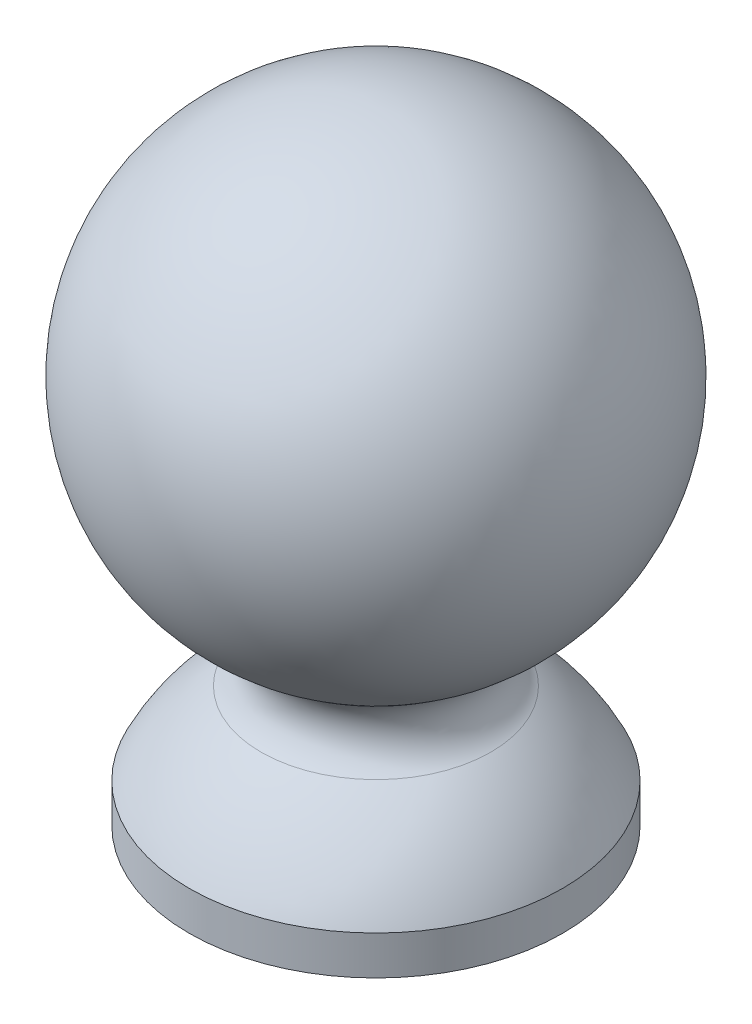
ISO-10303-21;
HEADER;
FILE_DESCRIPTION(('STEP AP214'),'2;1');
FILE_NAME('part.step','',(''),(''),'','','');
FILE_SCHEMA(('AUTOMOTIVE_DESIGN { 1 0 10303 214 1 1 1 1 }'));
ENDSEC;
DATA;
#1=APPLICATION_CONTEXT('core data for automotive mechanical design processes');
#2=APPLICATION_PROTOCOL_DEFINITION('international standard','automotive_design',2000,#1);
#3=PRODUCT_CONTEXT('',#1,'mechanical');
#4=PRODUCT('Part','Part','',(#3));
#5=PRODUCT_RELATED_PRODUCT_CATEGORY('part','',(#4));
#6=PRODUCT_DEFINITION_FORMATION('','',#4);
#7=PRODUCT_DEFINITION_CONTEXT('part definition',#1,'design');
#8=PRODUCT_DEFINITION('design','',#6,#7);
#9=PRODUCT_DEFINITION_SHAPE('','',#8);
#10=(LENGTH_UNIT() NAMED_UNIT(*) SI_UNIT(.MILLI.,.METRE.));
#11=(NAMED_UNIT(*) PLANE_ANGLE_UNIT() SI_UNIT($,.RADIAN.));
#12=(NAMED_UNIT(*) SI_UNIT($,.STERADIAN.) SOLID_ANGLE_UNIT());
#13=UNCERTAINTY_MEASURE_WITH_UNIT(LENGTH_MEASURE(1.E-05),#10,'distance_accuracy_value','');
#14=(GEOMETRIC_REPRESENTATION_CONTEXT(3) GLOBAL_UNCERTAINTY_ASSIGNED_CONTEXT((#13)) GLOBAL_UNIT_ASSIGNED_CONTEXT((#10,
#11,#12)) REPRESENTATION_CONTEXT('',''));
#15=CARTESIAN_POINT('',(0.,0.,0.));
#16=DIRECTION('',(0.,0.,1.));
#17=DIRECTION('',(1.,0.,0.));
#18=AXIS2_PLACEMENT_3D('',#15,#16,#17);
#19=CARTESIAN_POINT('',(0.,0.,0.));
#20=DIRECTION('',(0.,1.,0.));
#21=DIRECTION('',(1.,0.,0.));
#22=AXIS2_PLACEMENT_3D('',#19,#20,#21);
#23=SPHERICAL_SURFACE('',#22,30.);
#24=CARTESIAN_POINT('',(0.,-25.9637188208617,0.));
#25=DIRECTION('',(0.,1.,0.));
#26=DIRECTION('',(0.,0.,1.));
#27=AXIS2_PLACEMENT_3D('',#24,#25,#26);
#28=CIRCLE('',#27,15.0294811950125);
#29=CARTESIAN_POINT('',(0.,-25.9637188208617,15.0294811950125));
#30=VERTEX_POINT('',#29);
#31=EDGE_CURVE('E10',#30,#30,#28,.T.);
#32=ORIENTED_EDGE('',*,*,#31,.T.);
#33=EDGE_LOOP('',(#32));
#34=FACE_BOUND('',#33,.T.);
#35=ADVANCED_FACE('F31',(#34),#23,.T.);
#36=CARTESIAN_POINT('',(0.,-30.2910052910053,0.));
#37=DIRECTION('',(0.,1.,0.));
#38=DIRECTION('',(0.,0.,1.));
#39=AXIS2_PLACEMENT_3D('',#36,#37,#38);
#40=TOROIDAL_SURFACE('',#39,17.5343947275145,4.99999999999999);
#41=CARTESIAN_POINT('',(0.,-34.4564618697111,0.));
#42=DIRECTION('',(0.,1.,0.));
#43=DIRECTION('',(0.,0.,1.));
#44=AXIS2_PLACEMENT_3D('',#41,#42,#43);
#45=CIRCLE('',#44,14.7687173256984);
#46=CARTESIAN_POINT('',(-14.7687173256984,-34.4564618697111,0.));
#47=VERTEX_POINT('',#46);
#48=EDGE_CURVE('E37',#47,#47,#45,.T.);
#49=ORIENTED_EDGE('',*,*,#48,.T.);
#50=EDGE_LOOP('',(#49));
#51=FACE_BOUND('',#50,.T.);
#52=ORIENTED_EDGE('',*,*,#31,.F.);
#53=EDGE_LOOP('',(#52));
#54=FACE_BOUND('',#53,.T.);
#55=ADVANCED_FACE('F114',(#51,#54),#40,.F.);
#56=CARTESIAN_POINT('',(0.,-56.7,0.));
#57=DIRECTION('',(0.,1.,0.));
#58=DIRECTION('',(-1.,0.,0.));
#59=AXIS2_PLACEMENT_3D('',#56,#57,#58);
#60=SPHERICAL_SURFACE('',#59,26.7);
#61=CARTESIAN_POINT('',(0.,-45.,0.));
#62=DIRECTION('',(0.,-1.,0.));
#63=DIRECTION('',(0.,0.,-1.));
#64=AXIS2_PLACEMENT_3D('',#61,#62,#63);
#65=CIRCLE('',#64,24.);
#66=CARTESIAN_POINT('',(-24.,-45.,0.));
#67=VERTEX_POINT('',#66);
#68=EDGE_CURVE('E45',#67,#67,#65,.T.);
#69=CARTESIAN_POINT('',(-24.,-45.,0.));
#70=CARTESIAN_POINT('',(-23.9352752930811,-44.8672310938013,0.));
#71=CARTESIAN_POINT('',(-23.8694486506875,-44.7349993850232,0.));
#72=CARTESIAN_POINT('',(-23.7356100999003,-44.4716465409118,0.));
#73=CARTESIAN_POINT('',(-23.6675981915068,-44.3405254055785,0.));
#74=CARTESIAN_POINT('',(-23.5294077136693,-44.0794298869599,0.));
#75=CARTESIAN_POINT('',(-23.4592291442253,-43.9494555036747,0.));
#76=CARTESIAN_POINT('',(-23.31672470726,-43.690689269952,0.));
#77=CARTESIAN_POINT('',(-23.2443988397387,-43.5618974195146,0.));
#78=CARTESIAN_POINT('',(-23.0976197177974,-43.30553172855,0.));
#79=CARTESIAN_POINT('',(-23.0231664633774,-43.1779578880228,0.));
#80=CARTESIAN_POINT('',(-22.8721530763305,-42.9240633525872,0.));
#81=CARTESIAN_POINT('',(-22.7955929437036,-42.7977426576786,0.));
#82=CARTESIAN_POINT('',(-22.6403868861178,-42.5463892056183,0.));
#83=CARTESIAN_POINT('',(-22.5617409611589,-42.4213564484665,0.));
#84=CARTESIAN_POINT('',(-22.4023849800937,-42.1726133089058,0.));
#85=CARTESIAN_POINT('',(-22.3216749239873,-42.0489029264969,0.));
#86=CARTESIAN_POINT('',(-22.1582129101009,-41.8028386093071,0.));
#87=CARTESIAN_POINT('',(-22.0754609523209,-41.6804846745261,0.));
#88=CARTESIAN_POINT('',(-21.9079379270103,-41.4371669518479,0.));
#89=CARTESIAN_POINT('',(-21.8231668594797,-41.3162031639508,0.));
#90=CARTESIAN_POINT('',(-21.6516289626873,-41.0756990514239,0.));
#91=CARTESIAN_POINT('',(-21.5648621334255,-40.9561587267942,0.));
#92=CARTESIAN_POINT('',(-21.3893566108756,-40.718534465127,0.));
#93=CARTESIAN_POINT('',(-21.3006179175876,-40.6004505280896,0.));
#94=CARTESIAN_POINT('',(-21.1211931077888,-40.3657715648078,0.));
#95=CARTESIAN_POINT('',(-21.030506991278,-40.2491765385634,0.));
#96=CARTESIAN_POINT('',(-20.8472123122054,-40.0175075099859,0.));
#97=CARTESIAN_POINT('',(-20.7546037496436,-39.9024335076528,0.));
#98=CARTESIAN_POINT('',(-20.5674896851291,-39.6738382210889,0.));
#99=CARTESIAN_POINT('',(-20.4729841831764,-39.5603169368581,0.));
#100=CARTESIAN_POINT('',(-20.2821022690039,-39.3348583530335,0.));
#101=CARTESIAN_POINT('',(-20.1857258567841,-39.2229210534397,0.));
#102=CARTESIAN_POINT('',(-19.9911286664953,-39.0006612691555,0.));
#103=CARTESIAN_POINT('',(-19.8929078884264,-38.8903387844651,0.));
#104=CARTESIAN_POINT('',(-19.6946490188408,-38.6713390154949,0.));
#105=CARTESIAN_POINT('',(-19.5946109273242,-38.562661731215,0.));
#106=CARTESIAN_POINT('',(-19.3927449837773,-38.3469822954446,0.));
#107=CARTESIAN_POINT('',(-19.290917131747,-38.2399801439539,0.));
#108=CARTESIAN_POINT('',(-19.0854997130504,-38.0276804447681,0.));
#109=CARTESIAN_POINT('',(-18.9819101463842,-37.9223828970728,0.));
#110=CARTESIAN_POINT('',(-18.7729978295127,-37.7135214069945,0.));
#111=CARTESIAN_POINT('',(-18.6676750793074,-37.6099574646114,0.));
#112=CARTESIAN_POINT('',(-18.4553254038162,-37.4045917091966,0.));
#113=CARTESIAN_POINT('',(-18.3482984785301,-37.3027898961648,0.));
#114=CARTESIAN_POINT('',(-18.1325699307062,-37.1009764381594,0.));
#115=CARTESIAN_POINT('',(-18.0238683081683,-37.0009647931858,0.));
#116=CARTESIAN_POINT('',(-17.8048203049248,-36.8027592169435,0.));
#117=CARTESIAN_POINT('',(-17.6944739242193,-36.7045652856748,0.));
#118=CARTESIAN_POINT('',(-17.472166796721,-36.5100221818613,0.));
#119=CARTESIAN_POINT('',(-17.3602060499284,-36.4136730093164,0.));
#120=CARTESIAN_POINT('',(-17.1347010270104,-36.2228459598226,0.));
#121=CARTESIAN_POINT('',(-17.021156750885,-36.1283680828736,0.));
#122=CARTESIAN_POINT('',(-16.7925159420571,-35.941309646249,0.));
#123=CARTESIAN_POINT('',(-16.6774194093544,-35.8487290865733,0.));
#124=CARTESIAN_POINT('',(-16.4457057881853,-35.665490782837,0.));
#125=CARTESIAN_POINT('',(-16.3290886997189,-35.5748330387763,0.));
#126=CARTESIAN_POINT('',(-16.0943660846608,-35.3954653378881,0.));
#127=CARTESIAN_POINT('',(-15.9762605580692,-35.3067553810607,0.));
#128=CARTESIAN_POINT('',(-15.7385936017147,-35.1313076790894,0.));
#129=CARTESIAN_POINT('',(-15.6190321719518,-35.0445699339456,0.));
#130=CARTESIAN_POINT('',(-15.3784863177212,-34.8730905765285,0.));
#131=CARTESIAN_POINT('',(-15.2575018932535,-34.7883489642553,0.));
#132=CARTESIAN_POINT('',(-15.014143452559,-34.6208850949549,0.));
#133=CARTESIAN_POINT('',(-14.8917694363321,-34.5381628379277,0.));
#134=CARTESIAN_POINT('',(-14.7687173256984,-34.4564618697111,0.));
#135=B_SPLINE_CURVE_WITH_KNOTS('',3,(#69,#70,#71,#72,#73,#74,#75,#76,#77,#78,#79,#80,#81,#82,
#83,#84,#85,#86,#87,#88,#89,#90,#91,#92,#93,#94,#95,#96,#97,#98,#99,#100,#101,#102,#103,#104,
#105,#106,#107,#108,#109,#110,#111,#112,#113,#114,#115,#116,#117,#118,#119,#120,#121,#122,#123,
#124,#125,#126,#127,#128,#129,#130,#131,#132,#133,#134),.UNSPECIFIED.,.F.,.F.,(4,2,2,2,2,2,2,2,
2,2,2,2,2,2,2,2,2,2,2,2,2,2,2,2,2,2,2,2,2,2,2,2,4),(0.,0.443110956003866,0.88622191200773,
1.3293328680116,1.77244382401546,2.21555478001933,2.6586657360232,3.10177669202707,
3.54488764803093,3.9879986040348,4.43110956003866,4.87422051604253,5.3173314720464,
5.76044242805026,6.20355338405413,6.646664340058,7.08977529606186,7.53288625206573,
7.9759972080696,8.41910816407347,8.86221912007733,9.3053300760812,9.74844103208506,
10.1915519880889,10.6346629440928,11.0777739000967,11.5208848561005,11.9639958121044,
12.4071067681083,12.8502177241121,13.293328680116,13.7364396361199,14.1795505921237),.UNSPECIFIED.);
#136=EDGE_CURVE('BSEAM108',#67,#47,#135,.T.);
#137=ORIENTED_EDGE('',*,*,#68,.F.);
#138=ORIENTED_EDGE('',*,*,#48,.F.);
#139=ORIENTED_EDGE('',*,*,#136,.T.);
#140=ORIENTED_EDGE('',*,*,#136,.F.);
#141=EDGE_LOOP('',(#137,#139,#138,#140));
#142=FACE_BOUND('',#141,.T.);
#143=ADVANCED_FACE('F108',(#142),#60,.T.);
#144=CARTESIAN_POINT('',(0.,-50.,0.));
#145=DIRECTION('',(0.,1.,0.));
#146=DIRECTION('',(0.,0.,1.));
#147=AXIS2_PLACEMENT_3D('',#144,#145,#146);
#148=CYLINDRICAL_SURFACE('',#147,24.);
#149=CARTESIAN_POINT('',(0.,-50.,0.));
#150=DIRECTION('',(0.,-1.,0.));
#151=DIRECTION('',(0.,0.,-1.));
#152=AXIS2_PLACEMENT_3D('',#149,#150,#151);
#153=CIRCLE('',#152,24.);
#154=CARTESIAN_POINT('',(0.,-50.,-24.));
#155=VERTEX_POINT('',#154);
#156=EDGE_CURVE('E41',#155,#155,#153,.T.);
#157=ORIENTED_EDGE('',*,*,#156,.F.);
#158=EDGE_LOOP('',(#157));
#159=FACE_BOUND('',#158,.T.);
#160=ORIENTED_EDGE('',*,*,#68,.T.);
#161=EDGE_LOOP('',(#160));
#162=FACE_BOUND('',#161,.T.);
#163=ADVANCED_FACE('F94',(#159,#162),#148,.T.);
#164=CARTESIAN_POINT('',(0.,-50.,0.));
#165=DIRECTION('',(0.,-1.,0.));
#166=DIRECTION('',(0.,0.,-1.));
#167=AXIS2_PLACEMENT_3D('',#164,#165,#166);
#168=PLANE('',#167);
#169=CARTESIAN_POINT('',(-1.99014436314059E-13,-50.,-19.));
#170=DIRECTION('',(0.,-1.,0.));
#171=DIRECTION('',(0.,0.,-1.));
#172=AXIS2_PLACEMENT_3D('',#169,#170,#171);
#173=CIRCLE('',#172,2.75);
#174=CARTESIAN_POINT('',(-1.99014436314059E-13,-50.,-21.75));
#175=VERTEX_POINT('',#174);
#176=EDGE_CURVE('E75',#175,#175,#173,.T.);
#177=ORIENTED_EDGE('',*,*,#176,.F.);
#178=EDGE_LOOP('',(#177));
#179=FACE_BOUND('',#178,.T.);
#180=CARTESIAN_POINT('',(19.,-50.,-1.32676290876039E-13));
#181=DIRECTION('',(0.,-1.,0.));
#182=DIRECTION('',(0.,0.,-1.));
#183=AXIS2_PLACEMENT_3D('',#180,#181,#182);
#184=CIRCLE('',#183,2.75);
#185=CARTESIAN_POINT('',(19.,-50.,-2.75000000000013));
#186=VERTEX_POINT('',#185);
#187=EDGE_CURVE('E69',#186,#186,#184,.T.);
#188=ORIENTED_EDGE('',*,*,#187,.F.);
#189=EDGE_LOOP('',(#188));
#190=FACE_BOUND('',#189,.T.);
#191=CARTESIAN_POINT('',(0.,-50.,19.));
#192=DIRECTION('',(0.,-1.,0.));
#193=DIRECTION('',(0.,0.,-1.));
#194=AXIS2_PLACEMENT_3D('',#191,#192,#193);
#195=CIRCLE('',#194,2.75);
#196=CARTESIAN_POINT('',(0.,-50.,16.25));
#197=VERTEX_POINT('',#196);
#198=EDGE_CURVE('E63',#197,#197,#195,.T.);
#199=ORIENTED_EDGE('',*,*,#198,.F.);
#200=EDGE_LOOP('',(#199));
#201=FACE_BOUND('',#200,.T.);
#202=CARTESIAN_POINT('',(-19.,-50.,0.));
#203=DIRECTION('',(0.,-1.,0.));
#204=DIRECTION('',(0.,0.,-1.));
#205=AXIS2_PLACEMENT_3D('',#202,#203,#204);
#206=CIRCLE('',#205,2.75);
#207=CARTESIAN_POINT('',(-19.,-50.,-2.75));
#208=VERTEX_POINT('',#207);
#209=EDGE_CURVE('E57',#208,#208,#206,.T.);
#210=ORIENTED_EDGE('',*,*,#209,.F.);
#211=EDGE_LOOP('',(#210));
#212=FACE_BOUND('',#211,.T.);
#213=CARTESIAN_POINT('',(0.,-50.,0.));
#214=DIRECTION('',(0.,-1.,0.));
#215=DIRECTION('',(0.,0.,-1.));
#216=AXIS2_PLACEMENT_3D('',#213,#214,#215);
#217=CIRCLE('',#216,12.);
#218=CARTESIAN_POINT('',(0.,-50.,-12.));
#219=VERTEX_POINT('',#218);
#220=EDGE_CURVE('E51',#219,#219,#217,.T.);
#221=ORIENTED_EDGE('',*,*,#220,.F.);
#222=EDGE_LOOP('',(#221));
#223=FACE_BOUND('',#222,.T.);
#224=ORIENTED_EDGE('',*,*,#156,.T.);
#225=EDGE_LOOP('',(#224));
#226=FACE_BOUND('',#225,.T.);
#227=ADVANCED_FACE('F90',(#179,#190,#201,#212,#223,#226),#168,.T.);
#228=CARTESIAN_POINT('',(0.,-46.5,0.));
#229=DIRECTION('',(0.,-1.,0.));
#230=DIRECTION('',(0.,0.,-1.));
#231=AXIS2_PLACEMENT_3D('',#228,#229,#230);
#232=CYLINDRICAL_SURFACE('',#231,12.);
#233=CARTESIAN_POINT('',(0.,-46.5,0.));
#234=DIRECTION('',(0.,-1.,0.));
#235=DIRECTION('',(0.,0.,-1.));
#236=AXIS2_PLACEMENT_3D('',#233,#234,#235);
#237=CIRCLE('',#236,12.);
#238=CARTESIAN_POINT('',(0.,-46.5,-12.));
#239=VERTEX_POINT('',#238);
#240=EDGE_CURVE('E49',#239,#239,#237,.T.);
#241=ORIENTED_EDGE('',*,*,#240,.F.);
#242=EDGE_LOOP('',(#241));
#243=FACE_BOUND('',#242,.T.);
#244=ORIENTED_EDGE('',*,*,#220,.T.);
#245=EDGE_LOOP('',(#244));
#246=FACE_BOUND('',#245,.T.);
#247=ADVANCED_FACE('F93',(#243,#246),#232,.F.);
#248=CARTESIAN_POINT('',(0.,-46.5,0.));
#249=DIRECTION('',(0.,-1.,0.));
#250=DIRECTION('',(0.,0.,-1.));
#251=AXIS2_PLACEMENT_3D('',#248,#249,#250);
#252=PLANE('',#251);
#253=ORIENTED_EDGE('',*,*,#240,.T.);
#254=EDGE_LOOP('',(#253));
#255=FACE_BOUND('',#254,.T.);
#256=ADVANCED_FACE('F146',(#255),#252,.T.);
#257=CARTESIAN_POINT('',(-19.,-44.5,0.));
#258=DIRECTION('',(0.,-1.,0.));
#259=DIRECTION('',(0.,0.,-1.));
#260=AXIS2_PLACEMENT_3D('',#257,#258,#259);
#261=CYLINDRICAL_SURFACE('',#260,2.75);
#262=CARTESIAN_POINT('',(-19.,-44.5,0.));
#263=DIRECTION('',(0.,-1.,0.));
#264=DIRECTION('',(0.,0.,-1.));
#265=AXIS2_PLACEMENT_3D('',#262,#263,#264);
#266=CIRCLE('',#265,2.75);
#267=CARTESIAN_POINT('',(-19.,-44.5,-2.75));
#268=VERTEX_POINT('',#267);
#269=EDGE_CURVE('E54',#268,#268,#266,.T.);
#270=ORIENTED_EDGE('',*,*,#269,.F.);
#271=EDGE_LOOP('',(#270));
#272=FACE_BOUND('',#271,.T.);
#273=ORIENTED_EDGE('',*,*,#209,.T.);
#274=EDGE_LOOP('',(#273));
#275=FACE_BOUND('',#274,.T.);
#276=ADVANCED_FACE('F156',(#272,#275),#261,.F.);
#277=CARTESIAN_POINT('',(-19.,-44.5,0.));
#278=DIRECTION('',(0.,-1.,0.));
#279=DIRECTION('',(0.,0.,-1.));
#280=AXIS2_PLACEMENT_3D('',#277,#278,#279);
#281=PLANE('',#280);
#282=ORIENTED_EDGE('',*,*,#269,.T.);
#283=EDGE_LOOP('',(#282));
#284=FACE_BOUND('',#283,.T.);
#285=ADVANCED_FACE('F171',(#284),#281,.T.);
#286=CARTESIAN_POINT('',(0.,-44.5,19.));
#287=DIRECTION('',(0.,-1.,0.));
#288=DIRECTION('',(0.,0.,-1.));
#289=AXIS2_PLACEMENT_3D('',#286,#287,#288);
#290=CYLINDRICAL_SURFACE('',#289,2.75);
#291=CARTESIAN_POINT('',(0.,-44.5,19.));
#292=DIRECTION('',(0.,-1.,0.));
#293=DIRECTION('',(0.,0.,-1.));
#294=AXIS2_PLACEMENT_3D('',#291,#292,#293);
#295=CIRCLE('',#294,2.75);
#296=CARTESIAN_POINT('',(0.,-44.5,16.25));
#297=VERTEX_POINT('',#296);
#298=EDGE_CURVE('E60',#297,#297,#295,.T.);
#299=ORIENTED_EDGE('',*,*,#298,.F.);
#300=EDGE_LOOP('',(#299));
#301=FACE_BOUND('',#300,.T.);
#302=ORIENTED_EDGE('',*,*,#198,.T.);
#303=EDGE_LOOP('',(#302));
#304=FACE_BOUND('',#303,.T.);
#305=ADVANCED_FACE('F181',(#301,#304),#290,.F.);
#306=CARTESIAN_POINT('',(0.,-44.5,19.));
#307=DIRECTION('',(0.,-1.,0.));
#308=DIRECTION('',(0.,0.,-1.));
#309=AXIS2_PLACEMENT_3D('',#306,#307,#308);
#310=PLANE('',#309);
#311=ORIENTED_EDGE('',*,*,#298,.T.);
#312=EDGE_LOOP('',(#311));
#313=FACE_BOUND('',#312,.T.);
#314=ADVANCED_FACE('F191',(#313),#310,.T.);
#315=CARTESIAN_POINT('',(19.,-44.5,-1.32676290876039E-13));
#316=DIRECTION('',(0.,-1.,0.));
#317=DIRECTION('',(0.,0.,-1.));
#318=AXIS2_PLACEMENT_3D('',#315,#316,#317);
#319=CYLINDRICAL_SURFACE('',#318,2.75);
#320=CARTESIAN_POINT('',(19.,-44.5,-1.32676290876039E-13));
#321=DIRECTION('',(0.,-1.,0.));
#322=DIRECTION('',(0.,0.,-1.));
#323=AXIS2_PLACEMENT_3D('',#320,#321,#322);
#324=CIRCLE('',#323,2.75);
#325=CARTESIAN_POINT('',(19.,-44.5,-2.75000000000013));
#326=VERTEX_POINT('',#325);
#327=EDGE_CURVE('E66',#326,#326,#324,.T.);
#328=ORIENTED_EDGE('',*,*,#327,.F.);
#329=EDGE_LOOP('',(#328));
#330=FACE_BOUND('',#329,.T.);
#331=ORIENTED_EDGE('',*,*,#187,.T.);
#332=EDGE_LOOP('',(#331));
#333=FACE_BOUND('',#332,.T.);
#334=ADVANCED_FACE('F201',(#330,#333),#319,.F.);
#335=CARTESIAN_POINT('',(19.,-44.5,-1.32676290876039E-13));
#336=DIRECTION('',(0.,-1.,0.));
#337=DIRECTION('',(0.,0.,-1.));
#338=AXIS2_PLACEMENT_3D('',#335,#336,#337);
#339=PLANE('',#338);
#340=ORIENTED_EDGE('',*,*,#327,.T.);
#341=EDGE_LOOP('',(#340));
#342=FACE_BOUND('',#341,.T.);
#343=ADVANCED_FACE('F86',(#342),#339,.T.);
#344=CARTESIAN_POINT('',(-1.99014436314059E-13,-44.5,-19.));
#345=DIRECTION('',(0.,-1.,0.));
#346=DIRECTION('',(0.,0.,-1.));
#347=AXIS2_PLACEMENT_3D('',#344,#345,#346);
#348=CYLINDRICAL_SURFACE('',#347,2.75);
#349=CARTESIAN_POINT('',(-1.99014436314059E-13,-44.5,-19.));
#350=DIRECTION('',(0.,-1.,0.));
#351=DIRECTION('',(0.,0.,-1.));
#352=AXIS2_PLACEMENT_3D('',#349,#350,#351);
#353=CIRCLE('',#352,2.75);
#354=CARTESIAN_POINT('',(-1.99014436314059E-13,-44.5,-21.75));
#355=VERTEX_POINT('',#354);
#356=EDGE_CURVE('E72',#355,#355,#353,.T.);
#357=ORIENTED_EDGE('',*,*,#356,.F.);
#358=EDGE_LOOP('',(#357));
#359=FACE_BOUND('',#358,.T.);
#360=ORIENTED_EDGE('',*,*,#176,.T.);
#361=EDGE_LOOP('',(#360));
#362=FACE_BOUND('',#361,.T.);
#363=ADVANCED_FACE('F83',(#359,#362),#348,.F.);
#364=CARTESIAN_POINT('',(-1.99014436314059E-13,-44.5,-19.));
#365=DIRECTION('',(0.,-1.,0.));
#366=DIRECTION('',(0.,0.,-1.));
#367=AXIS2_PLACEMENT_3D('',#364,#365,#366);
#368=PLANE('',#367);
#369=ORIENTED_EDGE('',*,*,#356,.T.);
#370=EDGE_LOOP('',(#369));
#371=FACE_BOUND('',#370,.T.);
#372=ADVANCED_FACE('F81',(#371),#368,.T.);
#373=CLOSED_SHELL('',(#35,#55,#143,#163,#227,#247,#256,#276,#285,#305,#314,#334,#343,#363,#372));
#374=MANIFOLD_SOLID_BREP('B2',#373);
#375=ADVANCED_BREP_SHAPE_REPRESENTATION('',(#18,#374),#14);
#376=SHAPE_DEFINITION_REPRESENTATION(#9,#375);
ENDSEC;
END-ISO-10303-21;
